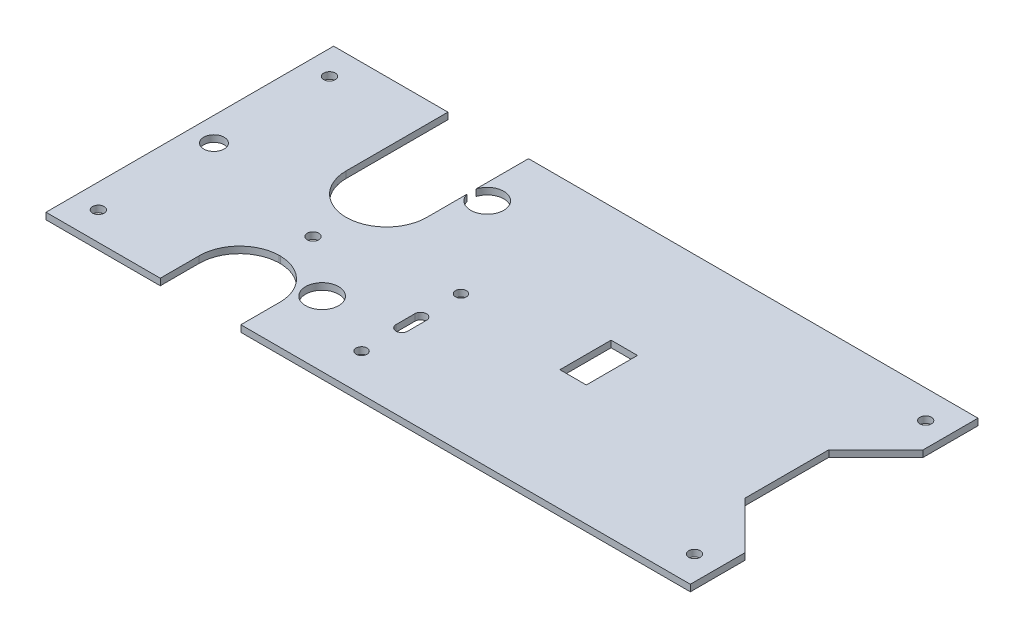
from build123d import *

# Parameters (mm, degrees)
ESQUISSE1_R        = 1.65
ESQUISSE1_R_2      = 5
ESQUISSE1_R_3      = 1.75
ESQUISSE1_R_4      = 3.1
ESQUISSE1_W        = 8
ESQUISSE1_H        = 15.5
BOSS_EXTRU_1_DEPTH = 2


with BuildPart() as part:
    # Esquisse1 → Boss.-Extru.1 (new body)
    with BuildSketch(Plane(origin=(0, 0, 0), x_dir=(1, 0, 0), z_dir=(0, 1, 0))):
        with BuildLine():
            ThreePointArc((-30.217606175, 22.897026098), (-20.417628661, 24.297103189), (-30.217606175, 25.697180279))
            Line((-30.217606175, 25.697180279), (-30.217606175, 41.597095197))
            Line((-30.217606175, 41.597095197), (105.882393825, 41.597095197))
            Line((105.882393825, 41.597095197), (105.882393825, 25.01130876))
            Line((105.882393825, 25.01130876), (91.582393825, 10.71130876))
            Line((91.582393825, 10.71130876), (91.582393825, -14.617118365))
            Line((91.582393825, -14.617118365), (105.882393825, -28.917118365))
            Line((105.882393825, -28.917118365), (105.882393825, -45.502904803))
            Line((105.882393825, -45.502904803), (-30.217606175, -45.502904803))
            Line((-30.217606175, -45.502904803), (-30.217606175, -33.702904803))
            ThreePointArc((-30.217606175, -33.702904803), (-33.702480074, -25.165541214), (-42.166225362, -21.505494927))
            Line((-42.166225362, -21.505494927), (-42.668986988, -21.505494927))
            ThreePointArc((-42.668986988, -21.505494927), (-51.132732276, -25.165541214), (-54.617606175, -33.702904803))
            Line((-54.617606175, -33.702904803), (-54.617606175, -45.502904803))
            Line((-54.617606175, -45.502904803), (-89.217606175, -45.502904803))
            Line((-89.217606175, -45.502904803), (-89.217606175, 41.597095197))
            Line((-89.217606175, 41.597095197), (-54.617606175, 41.597095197))
            Line((-54.617606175, 41.597095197), (-54.617606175, 10.797095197))
            ThreePointArc((-54.617606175, 10.797095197), (-51.133707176, 2.260726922), (-42.671772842, -1.400256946))
            Line((-42.671772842, -1.400256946), (-42.163439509, -1.400256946))
            ThreePointArc((-42.163439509, -1.400256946), (-33.701505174, 2.260726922), (-30.217606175, 10.797095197))
            Line((-30.217606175, 10.797095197), (-30.217606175, 22.897026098))
        make_face()
        with Locations(Location((-5.017606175, -34.152904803, 0), (0, 0, 270))):
            Circle(ESQUISSE1_R, mode=Mode.SUBTRACT)
        with Locations(Location((-5.017606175, -4.052904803, 0), (0, 0, 270))):
            Circle(ESQUISSE1_R, mode=Mode.SUBTRACT)
        with Locations(Location((-25.417628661, -25.702896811, 0), (0, 0, 270))):
            Circle(ESQUISSE1_R_2, mode=Mode.SUBTRACT)
        with Locations(Location((98.582393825, 33.047095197, 0), (0, 0, 270))):
            Circle(ESQUISSE1_R_3, mode=Mode.SUBTRACT)
        with Locations(Location((98.582393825, -36.952904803, 0), (0, 0, 270))):
            Circle(ESQUISSE1_R_3, mode=Mode.SUBTRACT)
        with Locations(Location((-42.417606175, -11.452904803, 0), (0, 0, 270))):
            Circle(ESQUISSE1_R_3, mode=Mode.SUBTRACT)
        with Locations(Location((-81.917606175, -1.952904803, 0), (0, 0, 270))):
            Circle(ESQUISSE1_R_4, mode=Mode.SUBTRACT)
        with Locations(Location((-81.917606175, -36.952904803, 0), (0, 0, 270))):
            Circle(ESQUISSE1_R_3, mode=Mode.SUBTRACT)
        with Locations(Location((-81.917606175, 33.047095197, 0), (0, 0, 270))):
            Circle(ESQUISSE1_R_3, mode=Mode.SUBTRACT)
        with BuildLine():
            ThreePointArc((-6.767606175, -21.952904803), (-5.017606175, -23.702904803), (-3.267606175, -21.952904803))
            Line((-3.267606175, -21.952904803), (-3.267606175, -16.252904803))
            ThreePointArc((-3.267606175, -16.252904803), (-5.017606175, -14.502904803), (-6.767606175, -16.252904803))
            Line((-6.767606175, -16.252904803), (-6.767606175, -21.952904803))
        make_face(mode=Mode.SUBTRACT)
        with Locations((33.882393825, -1.252904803)):
            Rectangle(ESQUISSE1_W, ESQUISSE1_H, mode=Mode.SUBTRACT)
    extrude(amount=BOSS_EXTRU_1_DEPTH)


solid = part.part
